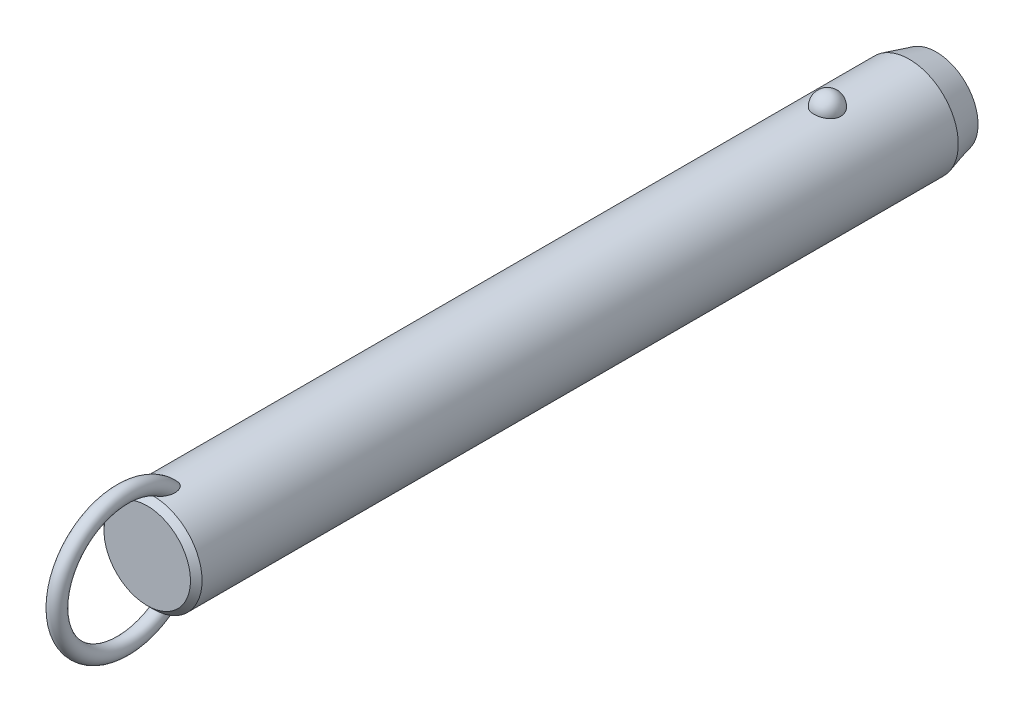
ISO-10303-21;
HEADER;
FILE_DESCRIPTION(('STEP AP214'),'2;1');
FILE_NAME('part.step','',(''),(''),'','','');
FILE_SCHEMA(('AUTOMOTIVE_DESIGN { 1 0 10303 214 1 1 1 1 }'));
ENDSEC;
DATA;
#1=APPLICATION_CONTEXT('core data for automotive mechanical design processes');
#2=APPLICATION_PROTOCOL_DEFINITION('international standard','automotive_design',2000,#1);
#3=PRODUCT_CONTEXT('',#1,'mechanical');
#4=PRODUCT('Part','Part','',(#3));
#5=PRODUCT_RELATED_PRODUCT_CATEGORY('part','',(#4));
#6=PRODUCT_DEFINITION_FORMATION('','',#4);
#7=PRODUCT_DEFINITION_CONTEXT('part definition',#1,'design');
#8=PRODUCT_DEFINITION('design','',#6,#7);
#9=PRODUCT_DEFINITION_SHAPE('','',#8);
#10=(LENGTH_UNIT() NAMED_UNIT(*) SI_UNIT(.MILLI.,.METRE.));
#11=(NAMED_UNIT(*) PLANE_ANGLE_UNIT() SI_UNIT($,.RADIAN.));
#12=(NAMED_UNIT(*) SI_UNIT($,.STERADIAN.) SOLID_ANGLE_UNIT());
#13=UNCERTAINTY_MEASURE_WITH_UNIT(LENGTH_MEASURE(1.E-05),#10,'distance_accuracy_value','');
#14=(GEOMETRIC_REPRESENTATION_CONTEXT(3) GLOBAL_UNCERTAINTY_ASSIGNED_CONTEXT((#13)) GLOBAL_UNIT_ASSIGNED_CONTEXT((#10,
#11,#12)) REPRESENTATION_CONTEXT('',''));
#15=CARTESIAN_POINT('',(0.,0.,0.));
#16=DIRECTION('',(0.,0.,1.));
#17=DIRECTION('',(1.,0.,0.));
#18=AXIS2_PLACEMENT_3D('',#15,#16,#17);
#19=CARTESIAN_POINT('',(0.,0.,160.));
#20=DIRECTION('',(0.,0.,-1.));
#21=DIRECTION('',(-1.,0.,0.));
#22=AXIS2_PLACEMENT_3D('',#19,#20,#21);
#23=CYLINDRICAL_SURFACE('',#22,12.7);
#24=CARTESIAN_POINT('',(3.46661256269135,12.2177165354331,-3.50000000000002));
#25=CARTESIAN_POINT('',(3.4666090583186,12.2177194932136,-3.30432790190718));
#26=CARTESIAN_POINT('',(3.45063567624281,12.2222841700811,-3.10861112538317));
#27=CARTESIAN_POINT('',(3.38712451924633,12.2400345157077,-2.72271899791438));
#28=CARTESIAN_POINT('',(3.33957415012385,12.2532236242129,-2.53254588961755));
#29=CARTESIAN_POINT('',(3.2141234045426,12.286724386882,-2.16324948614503));
#30=CARTESIAN_POINT('',(3.13623639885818,12.3070329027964,-1.98412136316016));
#31=CARTESIAN_POINT('',(2.95205930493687,12.3525018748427,-1.6418059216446));
#32=CARTESIAN_POINT('',(2.84577003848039,12.3776621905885,-1.47861814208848));
#33=CARTESIAN_POINT('',(2.60688050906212,12.4301712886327,-1.17190583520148));
#34=CARTESIAN_POINT('',(2.47415697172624,12.4575299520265,-1.0284789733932));
#35=CARTESIAN_POINT('',(2.18615174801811,12.5112810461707,-0.766177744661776));
#36=CARTESIAN_POINT('',(2.03087002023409,12.5376734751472,-0.647303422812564));
#37=CARTESIAN_POINT('',(1.70237334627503,12.5864761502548,-0.437732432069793));
#38=CARTESIAN_POINT('',(1.52920948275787,12.6088972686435,-0.346958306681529));
#39=CARTESIAN_POINT('',(1.16944170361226,12.6473352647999,-0.195750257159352));
#40=CARTESIAN_POINT('',(0.982839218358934,12.663352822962,-0.135313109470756));
#41=CARTESIAN_POINT('',(0.604961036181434,12.6869706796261,-0.0473241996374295));
#42=CARTESIAN_POINT('',(0.41382314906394,12.6947125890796,-0.0192185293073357));
#43=CARTESIAN_POINT('',(0.0293827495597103,12.7014203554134,0.00517254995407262));
#44=CARTESIAN_POINT('',(-0.163919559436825,12.7003870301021,0.00146092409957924));
#45=CARTESIAN_POINT('',(-0.544374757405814,12.689735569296,-0.0373939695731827));
#46=CARTESIAN_POINT('',(-0.731575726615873,12.6802364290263,-0.0721015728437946));
#47=CARTESIAN_POINT('',(-1.09733277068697,12.6538333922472,-0.171364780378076));
#48=CARTESIAN_POINT('',(-1.27588869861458,12.6369293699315,-0.235920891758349));
#49=CARTESIAN_POINT('',(-1.6204698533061,12.5973946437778,-0.393548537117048));
#50=CARTESIAN_POINT('',(-1.78641865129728,12.5747321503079,-0.486778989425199));
#51=CARTESIAN_POINT('',(-2.10030671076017,12.5261316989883,-0.699110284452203));
#52=CARTESIAN_POINT('',(-2.24824419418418,12.5001934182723,-0.818213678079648));
#53=CARTESIAN_POINT('',(-2.52491489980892,12.4472906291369,-1.0815712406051));
#54=CARTESIAN_POINT('',(-2.65324222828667,12.4203160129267,-1.22624992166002));
#55=CARTESIAN_POINT('',(-2.88410007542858,12.3687509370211,-1.53528325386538));
#56=CARTESIAN_POINT('',(-2.98662883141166,12.3441606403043,-1.69963924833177));
#57=CARTESIAN_POINT('',(-3.16432417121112,12.2998199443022,-2.04548497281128));
#58=CARTESIAN_POINT('',(-3.23917525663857,12.2801261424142,-2.22714424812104));
#59=CARTESIAN_POINT('',(-3.35800573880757,12.248167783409,-2.60091389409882));
#60=CARTESIAN_POINT('',(-3.4019860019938,12.2359030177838,-2.79302397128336));
#61=CARTESIAN_POINT('',(-3.45784812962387,12.2202347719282,-3.18140279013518));
#62=CARTESIAN_POINT('',(-3.46986123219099,12.2167950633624,-3.37765118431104));
#63=CARTESIAN_POINT('',(-3.46186273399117,12.2190638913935,-3.76943689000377));
#64=CARTESIAN_POINT('',(-3.44185196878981,12.2247721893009,-3.96497421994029));
#65=CARTESIAN_POINT('',(-3.37048652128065,12.2446381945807,-4.34881728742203));
#66=CARTESIAN_POINT('',(-3.31928253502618,12.2587552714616,-4.53715319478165));
#67=CARTESIAN_POINT('',(-3.18693461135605,12.2938237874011,-4.9023172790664));
#68=CARTESIAN_POINT('',(-3.1057895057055,12.3147754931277,-5.07914500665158));
#69=CARTESIAN_POINT('',(-2.91506431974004,12.3613125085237,-5.41732059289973));
#70=CARTESIAN_POINT('',(-2.80533587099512,12.3869217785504,-5.57858147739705));
#71=CARTESIAN_POINT('',(-2.560414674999,12.4398525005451,-5.88013283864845));
#72=CARTESIAN_POINT('',(-2.42522099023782,12.4671740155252,-6.02042254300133));
#73=CARTESIAN_POINT('',(-2.1323357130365,12.5205965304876,-6.27662798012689));
#74=CARTESIAN_POINT('',(-1.97456596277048,12.5466928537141,-6.39245542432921));
#75=CARTESIAN_POINT('',(-1.64115839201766,12.5946384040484,-6.59583547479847));
#76=CARTESIAN_POINT('',(-1.46552179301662,12.6164879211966,-6.68339001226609));
#77=CARTESIAN_POINT('',(-1.10356050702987,12.6532533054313,-6.82682153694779));
#78=CARTESIAN_POINT('',(-0.9173913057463,12.6682500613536,-6.88306988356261));
#79=CARTESIAN_POINT('',(-0.537836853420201,12.6900288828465,-6.96386887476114));
#80=CARTESIAN_POINT('',(-0.344452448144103,12.6968119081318,-6.98842322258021));
#81=CARTESIAN_POINT('',(0.0402577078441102,12.7013667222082,-7.00496469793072));
#82=CARTESIAN_POINT('',(0.231556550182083,12.6993008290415,-6.99753844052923));
#83=CARTESIAN_POINT('',(0.610105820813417,12.6867505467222,-6.95166366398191));
#84=CARTESIAN_POINT('',(0.797356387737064,12.6762664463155,-6.91321620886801));
#85=CARTESIAN_POINT('',(1.16186657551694,12.6480587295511,-6.80658431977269));
#86=CARTESIAN_POINT('',(1.33915951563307,12.6303611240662,-6.73850666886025));
#87=CARTESIAN_POINT('',(1.67968518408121,12.5896027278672,-6.57450875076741));
#88=CARTESIAN_POINT('',(1.84291705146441,12.5665416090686,-6.47858678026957));
#89=CARTESIAN_POINT('',(2.15340192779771,12.5171072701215,-6.25982455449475));
#90=CARTESIAN_POINT('',(2.30037831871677,12.4906895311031,-6.13660186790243));
#91=CARTESIAN_POINT('',(2.5717412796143,12.4376567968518,-5.86739587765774));
#92=CARTESIAN_POINT('',(2.69612388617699,12.4110417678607,-5.72140858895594));
#93=CARTESIAN_POINT('',(2.92107785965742,12.360051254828,-5.40794137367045));
#94=CARTESIAN_POINT('',(3.02121329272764,12.3357209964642,-5.24014110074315));
#95=CARTESIAN_POINT('',(3.19236291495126,12.2925446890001,-4.88969865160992));
#96=CARTESIAN_POINT('',(3.26338839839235,12.2736965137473,-4.70706226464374));
#97=CARTESIAN_POINT('',(3.36788038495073,12.245404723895,-4.35469510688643));
#98=CARTESIAN_POINT('',(3.40484026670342,12.2351018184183,-4.18605935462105));
#99=CARTESIAN_POINT('',(3.45420764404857,12.2212564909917,-3.84496058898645));
#100=CARTESIAN_POINT('',(3.46661565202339,12.2177139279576,-3.67249765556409));
#101=CARTESIAN_POINT('',(3.46661256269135,12.2177165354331,-3.50000000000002));
#102=B_SPLINE_CURVE_WITH_KNOTS('',3,(#24,#25,#26,#27,#28,#29,#30,#31,#32,#33,#34,#35,#36,#37,
#38,#39,#40,#41,#42,#43,#44,#45,#46,#47,#48,#49,#50,#51,#52,#53,#54,#55,#56,#57,#58,#59,#60,#61,
#62,#63,#64,#65,#66,#67,#68,#69,#70,#71,#72,#73,#74,#75,#76,#77,#78,#79,#80,#81,#82,#83,#84,#85,
#86,#87,#88,#89,#90,#91,#92,#93,#94,#95,#96,#97,#98,#99,#100,#101),.UNSPECIFIED.,.T.,.F.,(4,2,2,
2,2,2,2,2,2,2,2,2,2,2,2,2,2,2,2,2,2,2,2,2,2,2,2,2,2,2,2,2,2,2,2,2,2,2,4),(0.,0.586396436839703,
1.17302689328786,1.7593990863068,2.34575431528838,2.93491084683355,3.52406845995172,
4.11158733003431,4.69904375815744,5.2762784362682,5.85345931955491,6.42265312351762,
6.99185659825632,7.56427334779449,8.136746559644,8.71981013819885,9.3029135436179,
9.89247258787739,10.4820150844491,11.0691335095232,11.6562366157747,12.2405256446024,
12.8248374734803,13.412244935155,13.9996740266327,14.5891883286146,15.1786623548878,
15.7609861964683,16.3432419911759,16.9148635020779,17.4864654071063,18.0560241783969,
18.6256177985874,19.2037609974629,19.7820055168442,20.3699810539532,20.957728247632,
21.4746855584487,21.9916320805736),.UNSPECIFIED.);
#103=CARTESIAN_POINT('',(3.46661256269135,12.2177165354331,-3.50000000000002));
#104=VERTEX_POINT('',#103);
#105=EDGE_CURVE('E41',#104,#104,#102,.T.);
#106=ORIENTED_EDGE('',*,*,#105,.T.);
#107=EDGE_LOOP('',(#106));
#108=FACE_BOUND('',#107,.T.);
#109=CARTESIAN_POINT('',(0.,0.,171.2));
#110=DIRECTION('',(0.,0.,1.));
#111=DIRECTION('',(1.,0.,0.));
#112=AXIS2_PLACEMENT_3D('',#109,#110,#111);
#113=CIRCLE('',#112,12.7);
#114=CARTESIAN_POINT('',(12.7,0.,171.2));
#115=VERTEX_POINT('',#114);
#116=EDGE_CURVE('E10',#115,#115,#113,.F.);
#117=ORIENTED_EDGE('',*,*,#116,.T.);
#118=EDGE_LOOP('',(#117));
#119=FACE_BOUND('',#118,.T.);
#120=CARTESIAN_POINT('',(-0.548122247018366,-12.6881662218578,164.943218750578));
#121=CARTESIAN_POINT('',(-0.648865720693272,-12.6838128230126,164.977926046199));
#122=CARTESIAN_POINT('',(-0.746398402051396,-12.6783867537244,165.022042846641));
#123=CARTESIAN_POINT('',(-0.932125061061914,-12.666091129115,165.126764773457));
#124=CARTESIAN_POINT('',(-1.02030388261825,-12.6592192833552,165.187396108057));
#125=CARTESIAN_POINT('',(-1.18487740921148,-12.6448747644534,165.321847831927));
#126=CARTESIAN_POINT('',(-1.26134296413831,-12.637406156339,165.395582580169));
#127=CARTESIAN_POINT('',(-1.4023120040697,-12.6225412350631,165.553604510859));
#128=CARTESIAN_POINT('',(-1.466814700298,-12.6151449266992,165.63789238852));
#129=CARTESIAN_POINT('',(-1.60714786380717,-12.5981718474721,165.849657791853));
#130=CARTESIAN_POINT('',(-1.67725126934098,-12.588900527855,165.980962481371));
#131=CARTESIAN_POINT('',(-1.79536591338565,-12.5725964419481,166.253247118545));
#132=CARTESIAN_POINT('',(-1.84333535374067,-12.5655679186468,166.394244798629));
#133=CARTESIAN_POINT('',(-1.93422576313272,-12.5519624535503,166.737645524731));
#134=CARTESIAN_POINT('',(-1.96788773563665,-12.5466298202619,166.942557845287));
#135=CARTESIAN_POINT('',(-1.9941399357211,-12.542463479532,167.251760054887));
#136=CARTESIAN_POINT('',(-1.99883864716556,-12.5417153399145,167.355298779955));
#137=CARTESIAN_POINT('',(-2.00078003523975,-12.5414074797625,167.56245124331));
#138=CARTESIAN_POINT('',(-1.99802449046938,-12.5418474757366,167.666064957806));
#139=CARTESIAN_POINT('',(-1.98336733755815,-12.5441750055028,167.91032076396));
#140=CARTESIAN_POINT('',(-1.96851430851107,-12.5465291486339,168.050780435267));
#141=CARTESIAN_POINT('',(-1.92707089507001,-12.5529612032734,168.329960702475));
#142=CARTESIAN_POINT('',(-1.90047458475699,-12.5570399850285,168.468680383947));
#143=CARTESIAN_POINT('',(-1.83619120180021,-12.5666008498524,168.74341135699));
#144=CARTESIAN_POINT('',(-1.79850828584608,-12.57208240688,168.879423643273));
#145=CARTESIAN_POINT('',(-1.71223796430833,-12.5841228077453,169.147842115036));
#146=CARTESIAN_POINT('',(-1.66365679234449,-12.5906810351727,169.280250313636));
#147=CARTESIAN_POINT('',(-1.57804503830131,-12.6016176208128,169.48548877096));
#148=CARTESIAN_POINT('',(-1.54477252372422,-12.6057501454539,169.559914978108));
#149=CARTESIAN_POINT('',(-1.47424480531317,-12.6141930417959,169.706839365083));
#150=CARTESIAN_POINT('',(-1.43699041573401,-12.6185033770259,169.779337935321));
#151=CARTESIAN_POINT('',(-1.35825795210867,-12.6272207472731,169.921892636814));
#152=CARTESIAN_POINT('',(-1.31678520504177,-12.6316276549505,169.991951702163));
#153=CARTESIAN_POINT('',(-1.22917793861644,-12.6404532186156,170.129070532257));
#154=CARTESIAN_POINT('',(-1.18304514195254,-12.6448718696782,170.196131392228));
#155=CARTESIAN_POINT('',(-1.07246411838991,-12.6547893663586,170.343874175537));
#156=CARTESIAN_POINT('',(-1.0064223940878,-12.6602600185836,170.423384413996));
#157=CARTESIAN_POINT('',(-0.864441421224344,-12.6707460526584,170.573169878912));
#158=CARTESIAN_POINT('',(-0.788516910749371,-12.6757620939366,170.643458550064));
#159=CARTESIAN_POINT('',(-0.652215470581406,-12.6833591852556,170.748680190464));
#160=CARTESIAN_POINT('',(-0.594982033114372,-12.6861973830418,170.787624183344));
#161=CARTESIAN_POINT('',(-0.475269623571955,-12.6912445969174,170.856489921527));
#162=CARTESIAN_POINT('',(-0.412800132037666,-12.6934547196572,170.886427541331));
#163=CARTESIAN_POINT('',(-0.295749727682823,-12.6966636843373,170.92975652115));
#164=CARTESIAN_POINT('',(-0.2419499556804,-12.6978134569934,170.945218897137));
#165=CARTESIAN_POINT('',(-0.13250810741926,-12.6994261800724,170.966884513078));
#166=CARTESIAN_POINT('',(-0.0768679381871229,-12.6998898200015,170.973097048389));
#167=CARTESIAN_POINT('',(0.0347696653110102,-12.7000752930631,170.975583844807));
#168=CARTESIAN_POINT('',(0.0907676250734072,-12.6997954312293,170.971835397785));
#169=CARTESIAN_POINT('',(0.20128301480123,-12.6985255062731,170.954788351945));
#170=CARTESIAN_POINT('',(0.255799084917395,-12.6975348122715,170.941481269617));
#171=CARTESIAN_POINT('',(0.376042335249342,-12.6946091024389,170.90203792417));
#172=CARTESIAN_POINT('',(0.440950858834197,-12.6924943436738,170.873449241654));
#173=CARTESIAN_POINT('',(0.56535027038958,-12.6875639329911,170.806323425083));
#174=CARTESIAN_POINT('',(0.624828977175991,-12.6847467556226,170.767764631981));
#175=CARTESIAN_POINT('',(0.774116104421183,-12.6767252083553,170.656949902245));
#176=CARTESIAN_POINT('',(0.859449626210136,-12.6711344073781,170.578760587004));
#177=CARTESIAN_POINT('',(1.01789440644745,-12.6593922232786,170.410943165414));
#178=CARTESIAN_POINT('',(1.09096902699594,-12.653239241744,170.321282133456));
#179=CARTESIAN_POINT('',(1.22268793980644,-12.6411674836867,170.140265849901));
#180=CARTESIAN_POINT('',(1.28193986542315,-12.6352572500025,170.049345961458));
#181=CARTESIAN_POINT('',(1.39259777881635,-12.6235401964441,169.862792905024));
#182=CARTESIAN_POINT('',(1.44399707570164,-12.6177334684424,169.767155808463));
#183=CARTESIAN_POINT('',(1.53972870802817,-12.6064093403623,169.572273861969));
#184=CARTESIAN_POINT('',(1.58405262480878,-12.6008922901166,169.473024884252));
#185=CARTESIAN_POINT('',(1.66600705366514,-12.5903187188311,169.271772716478));
#186=CARTESIAN_POINT('',(1.70363651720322,-12.5852622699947,169.169769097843));
#187=CARTESIAN_POINT('',(1.77545379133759,-12.5753406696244,168.954358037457));
#188=CARTESIAN_POINT('',(1.80903453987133,-12.5705328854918,168.840745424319));
#189=CARTESIAN_POINT('',(1.86844163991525,-12.5618400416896,168.611457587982));
#190=CARTESIAN_POINT('',(1.89426665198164,-12.5579551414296,168.495782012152));
#191=CARTESIAN_POINT('',(1.93785464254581,-12.5513030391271,168.263007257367));
#192=CARTESIAN_POINT('',(1.95562640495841,-12.5485346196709,168.145909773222));
#193=CARTESIAN_POINT('',(1.98264463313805,-12.5442934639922,167.910747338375));
#194=CARTESIAN_POINT('',(1.99189298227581,-12.5428204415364,167.79268260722));
#195=CARTESIAN_POINT('',(2.00416068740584,-12.540871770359,167.480622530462));
#196=CARTESIAN_POINT('',(1.99944433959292,-12.541631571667,167.286229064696));
#197=CARTESIAN_POINT('',(1.96113755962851,-12.5476846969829,166.900309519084));
#198=CARTESIAN_POINT('',(1.92758341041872,-12.5529723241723,166.708780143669));
#199=CARTESIAN_POINT('',(1.83934342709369,-12.5661532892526,166.382272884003));
#200=CARTESIAN_POINT('',(1.79215440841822,-12.5730485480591,166.24524997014));
#201=CARTESIAN_POINT('',(1.67676242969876,-12.588958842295,165.980445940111));
#202=CARTESIAN_POINT('',(1.60859050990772,-12.597970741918,165.852651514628));
#203=CARTESIAN_POINT('',(1.46583832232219,-12.6152829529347,165.635800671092));
#204=CARTESIAN_POINT('',(1.39525727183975,-12.6233659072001,165.54410500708));
#205=CARTESIAN_POINT('',(1.2399259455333,-12.6395676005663,165.373485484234));
#206=CARTESIAN_POINT('',(1.15517932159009,-12.6476863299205,165.294558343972));
#207=CARTESIAN_POINT('',(0.971995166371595,-12.6630846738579,165.152643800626));
#208=CARTESIAN_POINT('',(0.873456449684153,-12.6703572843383,165.089784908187));
#209=CARTESIAN_POINT('',(0.665847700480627,-12.6829569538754,164.984487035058));
#210=CARTESIAN_POINT('',(0.556784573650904,-12.688285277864,164.942034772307));
#211=CARTESIAN_POINT('',(0.347338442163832,-12.6956226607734,164.884443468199));
#212=CARTESIAN_POINT('',(0.24775974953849,-12.6979816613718,164.866399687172));
#213=CARTESIAN_POINT('',(0.0470218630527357,-12.7003077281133,164.848600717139));
#214=CARTESIAN_POINT('',(-0.0541350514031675,-12.7002779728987,164.848821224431));
#215=CARTESIAN_POINT('',(-0.22141402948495,-12.6982482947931,164.864363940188));
#216=CARTESIAN_POINT('',(-0.288055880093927,-12.6969033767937,164.874666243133));
#217=CARTESIAN_POINT('',(-0.419599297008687,-12.6932369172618,164.90313489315));
#218=CARTESIAN_POINT('',(-0.484501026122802,-12.6909154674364,164.921300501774));
#219=CARTESIAN_POINT('',(-0.548122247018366,-12.6881662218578,164.943218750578));
#220=B_SPLINE_CURVE_WITH_KNOTS('',3,(#120,#121,#122,#123,#124,#125,#126,#127,#128,#129,#130,
#131,#132,#133,#134,#135,#136,#137,#138,#139,#140,#141,#142,#143,#144,#145,#146,#147,#148,#149,
#150,#151,#152,#153,#154,#155,#156,#157,#158,#159,#160,#161,#162,#163,#164,#165,#166,#167,#168,
#169,#170,#171,#172,#173,#174,#175,#176,#177,#178,#179,#180,#181,#182,#183,#184,#185,#186,#187,
#188,#189,#190,#191,#192,#193,#194,#195,#196,#197,#198,#199,#200,#201,#202,#203,#204,#205,#206,
#207,#208,#209,#210,#211,#212,#213,#214,#215,#216,#217,#218,#219),.UNSPECIFIED.,.T.,.F.,(4,2,2,
2,2,2,2,2,2,2,2,2,2,2,2,2,2,2,2,2,2,2,2,2,2,2,2,2,2,2,2,2,2,2,2,2,2,2,2,2,2,2,2,2,2,2,2,2,2,4),
(0.,0.31964225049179,0.639794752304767,0.957927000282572,1.27608021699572,1.72100165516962,
2.16675988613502,2.78630021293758,3.09705782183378,3.40774128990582,3.83096358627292,
4.25439969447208,4.67767724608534,5.1007133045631,5.34550297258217,5.59024267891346,
5.83467707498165,6.07902143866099,6.38891080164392,6.69834321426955,6.90560910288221,
7.11250749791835,7.27977315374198,7.44687060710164,7.61434932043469,7.78197685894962,
7.99365544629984,8.20579780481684,8.55147335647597,8.89816429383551,9.22375138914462,
9.54961437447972,9.87586224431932,10.202161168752,10.557587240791,10.9130746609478,
11.2681734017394,11.6231936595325,12.2046601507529,12.7853961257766,13.219164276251,
13.6522938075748,13.9989174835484,14.3454519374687,14.6946768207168,15.0436740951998,
15.3457513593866,15.6474266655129,15.8493051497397,16.0511646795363),.UNSPECIFIED.);
#221=CARTESIAN_POINT('',(-0.548122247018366,-12.6881662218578,164.943218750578));
#222=VERTEX_POINT('',#221);
#223=EDGE_CURVE('E60',#222,#222,#220,.T.);
#224=ORIENTED_EDGE('',*,*,#223,.T.);
#225=EDGE_LOOP('',(#224));
#226=FACE_BOUND('',#225,.T.);
#227=CARTESIAN_POINT('',(-0.548122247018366,12.6881662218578,164.943218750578));
#228=CARTESIAN_POINT('',(-0.459436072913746,12.6919968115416,164.912673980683));
#229=CARTESIAN_POINT('',(-0.368189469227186,12.6949996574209,164.889391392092));
#230=CARTESIAN_POINT('',(-0.183024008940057,12.6990186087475,164.858406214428));
#231=CARTESIAN_POINT('',(-0.0891049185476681,12.7000345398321,164.850704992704));
#232=CARTESIAN_POINT('',(0.0987147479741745,12.6999636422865,164.851245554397));
#233=CARTESIAN_POINT('',(0.192615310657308,12.6988761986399,164.859492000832));
#234=CARTESIAN_POINT('',(0.377658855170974,12.6947211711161,164.891551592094));
#235=CARTESIAN_POINT('',(0.468801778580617,12.6916535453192,164.915365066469));
#236=CARTESIAN_POINT('',(0.645809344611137,12.6838788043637,164.97745651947));
#237=CARTESIAN_POINT('',(0.731679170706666,12.6791733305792,165.015720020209));
#238=CARTESIAN_POINT('',(0.896315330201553,12.6686004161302,165.105120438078));
#239=CARTESIAN_POINT('',(0.97508059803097,12.6627328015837,165.156259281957));
#240=CARTESIAN_POINT('',(1.12963655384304,12.6499161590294,165.27367820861));
#241=CARTESIAN_POINT('',(1.20478673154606,12.6429194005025,165.340792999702));
#242=CARTESIAN_POINT('',(1.34448241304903,12.6288282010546,165.48522507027));
#243=CARTESIAN_POINT('',(1.40902173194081,12.621733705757,165.562548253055));
#244=CARTESIAN_POINT('',(1.55208211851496,12.6050877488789,165.759247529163));
#245=CARTESIAN_POINT('',(1.62510490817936,12.5957546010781,165.882654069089));
#246=CARTESIAN_POINT('',(1.75019044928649,12.5789823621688,166.139769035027));
#247=CARTESIAN_POINT('',(1.8022137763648,12.5715468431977,166.273496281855));
#248=CARTESIAN_POINT('',(1.90309965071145,12.5567434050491,166.598351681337));
#249=CARTESIAN_POINT('',(1.94342317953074,12.5504515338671,166.792161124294));
#250=CARTESIAN_POINT('',(1.99332997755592,12.5426147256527,167.18378810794));
#251=CARTESIAN_POINT('',(2.00285305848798,12.5410790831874,167.381612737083));
#252=CARTESIAN_POINT('',(1.99678999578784,12.5420407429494,167.716642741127));
#253=CARTESIAN_POINT('',(1.98794117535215,12.5434564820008,167.854042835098));
#254=CARTESIAN_POINT('',(1.95865119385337,12.5480641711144,168.127639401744));
#255=CARTESIAN_POINT('',(1.93820436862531,12.5512569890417,168.263835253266));
#256=CARTESIAN_POINT('',(1.88647896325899,12.5591352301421,168.534249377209));
#257=CARTESIAN_POINT('',(1.85518800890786,12.5638223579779,168.668465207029));
#258=CARTESIAN_POINT('',(1.78217886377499,12.5743868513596,168.933936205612));
#259=CARTESIAN_POINT('',(1.74046509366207,12.5802637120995,169.065192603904));
#260=CARTESIAN_POINT('',(1.66024095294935,12.5910571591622,169.286085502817));
#261=CARTESIAN_POINT('',(1.62434772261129,12.5957535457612,169.376690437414));
#262=CARTESIAN_POINT('',(1.54709009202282,12.6054762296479,169.555512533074));
#263=CARTESIAN_POINT('',(1.50572681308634,12.6105024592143,169.643730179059));
#264=CARTESIAN_POINT('',(1.41728020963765,12.620748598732,169.816932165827));
#265=CARTESIAN_POINT('',(1.37021377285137,12.625967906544,169.901925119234));
#266=CARTESIAN_POINT('',(1.26969620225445,12.6364721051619,170.068007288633));
#267=CARTESIAN_POINT('',(1.21624929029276,12.6417569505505,170.149099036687));
#268=CARTESIAN_POINT('',(1.1030441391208,12.6521331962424,170.304702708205));
#269=CARTESIAN_POINT('',(1.04340936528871,12.657226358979,170.379303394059));
#270=CARTESIAN_POINT('',(0.915919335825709,12.667090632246,170.521324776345));
#271=CARTESIAN_POINT('',(0.848064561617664,12.6718617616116,170.58874589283));
#272=CARTESIAN_POINT('',(0.717035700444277,12.67987711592,170.700624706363));
#273=CARTESIAN_POINT('',(0.655526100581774,12.6832377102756,170.746997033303));
#274=CARTESIAN_POINT('',(0.525985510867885,12.6892676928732,170.829619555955));
#275=CARTESIAN_POINT('',(0.457969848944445,12.6919386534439,170.865892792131));
#276=CARTESIAN_POINT('',(0.334859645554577,12.695691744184,170.916657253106));
#277=CARTESIAN_POINT('',(0.281116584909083,12.6970073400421,170.934373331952));
#278=CARTESIAN_POINT('',(0.171425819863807,12.6989609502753,170.960642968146));
#279=CARTESIAN_POINT('',(0.115480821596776,12.699599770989,170.969207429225));
#280=CARTESIAN_POINT('',(0.00272618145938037,12.7001251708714,170.976253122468));
#281=CARTESIAN_POINT('',(-0.0540859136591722,12.7000089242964,170.974696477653));
#282=CARTESIAN_POINT('',(-0.16654462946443,12.6990328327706,170.961600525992));
#283=CARTESIAN_POINT('',(-0.222190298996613,12.6981724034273,170.950053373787));
#284=CARTESIAN_POINT('',(-0.342018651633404,12.695562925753,170.914912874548));
#285=CARTESIAN_POINT('',(-0.405606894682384,12.6936676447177,170.88933225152));
#286=CARTESIAN_POINT('',(-0.527815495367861,12.6891754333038,170.828311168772));
#287=CARTESIAN_POINT('',(-0.586425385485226,12.6865770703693,170.792850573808));
#288=CARTESIAN_POINT('',(-0.731842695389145,12.6792129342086,170.691496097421));
#289=CARTESIAN_POINT('',(-0.81470941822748,12.6740767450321,170.6200395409));
#290=CARTESIAN_POINT('',(-0.969101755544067,12.6632083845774,170.46589007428));
#291=CARTESIAN_POINT('',(-1.04059564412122,12.6574746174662,170.383166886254));
#292=CARTESIAN_POINT('',(-1.16981116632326,12.6461638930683,170.215809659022));
#293=CARTESIAN_POINT('',(-1.22811369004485,12.6405994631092,170.131616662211));
#294=CARTESIAN_POINT('',(-1.33743405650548,12.6295007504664,169.958579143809));
#295=CARTESIAN_POINT('',(-1.38844577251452,12.6239664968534,169.869730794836));
#296=CARTESIAN_POINT('',(-1.48400702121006,12.6130898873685,169.688389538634));
#297=CARTESIAN_POINT('',(-1.52854232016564,12.6077479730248,169.595889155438));
#298=CARTESIAN_POINT('',(-1.61150113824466,12.5974127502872,169.408160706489));
#299=CARTESIAN_POINT('',(-1.64992317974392,12.5924195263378,169.312931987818));
#300=CARTESIAN_POINT('',(-1.73468589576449,12.581070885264,169.08289362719));
#301=CARTESIAN_POINT('',(-1.77831261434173,12.5749388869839,168.947066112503));
#302=CARTESIAN_POINT('',(-1.85439734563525,12.5639437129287,168.672212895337));
#303=CARTESIAN_POINT('',(-1.88684994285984,12.5590811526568,168.533185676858));
#304=CARTESIAN_POINT('',(-1.94008483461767,12.550968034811,168.25309235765));
#305=CARTESIAN_POINT('',(-1.96088706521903,12.5477147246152,168.112030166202));
#306=CARTESIAN_POINT('',(-1.99000539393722,12.5431291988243,167.828668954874));
#307=CARTESIAN_POINT('',(-1.99832911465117,12.5417958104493,167.686370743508));
#308=CARTESIAN_POINT('',(-2.00166624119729,12.5412674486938,167.357627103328));
#309=CARTESIAN_POINT('',(-1.99178843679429,12.5428579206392,167.171088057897));
#310=CARTESIAN_POINT('',(-1.94455183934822,12.5502731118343,166.80162404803));
#311=CARTESIAN_POINT('',(-1.90724032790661,12.5560905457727,166.618693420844));
#312=CARTESIAN_POINT('',(-1.81330718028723,12.5699462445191,166.304848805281));
#313=CARTESIAN_POINT('',(-1.76338820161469,12.5771273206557,166.171910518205));
#314=CARTESIAN_POINT('',(-1.64305018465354,12.593414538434,165.915681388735));
#315=CARTESIAN_POINT('',(-1.57265346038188,12.6025185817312,165.792380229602));
#316=CARTESIAN_POINT('',(-1.42634956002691,12.6198178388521,165.583564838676));
#317=CARTESIAN_POINT('',(-1.35423772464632,12.6278405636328,165.495384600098));
#318=CARTESIAN_POINT('',(-1.19645664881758,12.6437632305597,165.332107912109));
#319=CARTESIAN_POINT('',(-1.1108053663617,12.6516633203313,165.256994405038));
#320=CARTESIAN_POINT('',(-0.947219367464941,12.6648319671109,165.137811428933));
#321=CARTESIAN_POINT('',(-0.871624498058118,12.670300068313,165.090541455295));
#322=CARTESIAN_POINT('',(-0.714161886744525,12.6801492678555,165.0077413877));
#323=CARTESIAN_POINT('',(-0.632295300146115,12.684530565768,164.97220913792));
#324=CARTESIAN_POINT('',(-0.548122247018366,12.6881662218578,164.943218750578));
#325=B_SPLINE_CURVE_WITH_KNOTS('',3,(#227,#228,#229,#230,#231,#232,#233,#234,#235,#236,#237,
#238,#239,#240,#241,#242,#243,#244,#245,#246,#247,#248,#249,#250,#251,#252,#253,#254,#255,#256,
#257,#258,#259,#260,#261,#262,#263,#264,#265,#266,#267,#268,#269,#270,#271,#272,#273,#274,#275,
#276,#277,#278,#279,#280,#281,#282,#283,#284,#285,#286,#287,#288,#289,#290,#291,#292,#293,#294,
#295,#296,#297,#298,#299,#300,#301,#302,#303,#304,#305,#306,#307,#308,#309,#310,#311,#312,#313,
#314,#315,#316,#317,#318,#319,#320,#321,#322,#323,#324),.UNSPECIFIED.,.T.,.F.,(4,2,2,2,2,2,2,2,
2,2,2,2,2,2,2,2,2,2,2,2,2,2,2,2,2,2,2,2,2,2,2,2,2,2,2,2,2,2,2,2,2,2,2,2,2,2,2,2,4),(0.,
0.281328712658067,0.562682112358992,0.844117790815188,1.12555942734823,1.40671982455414,
1.68792232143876,1.98972294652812,2.29169886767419,2.72039860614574,3.14989948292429,
3.74084916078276,4.33295293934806,4.74554109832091,5.15833092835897,5.57159335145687,
5.98468079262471,6.27722775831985,6.56971484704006,6.86135609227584,7.15280542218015,
7.43927407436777,7.72572595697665,7.95635862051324,8.18646071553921,8.35559393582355,
8.52452541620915,8.69408946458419,8.86378678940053,9.06834348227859,9.27332014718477,
9.60010414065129,9.92778432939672,10.2350252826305,10.5425229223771,10.8506864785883,
11.15892440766,11.5867893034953,12.0148612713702,12.4421984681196,12.8692745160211,
13.4279365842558,13.9856380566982,14.4107062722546,14.835313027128,15.1765567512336,
15.517351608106,15.7844129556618,16.051425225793),.UNSPECIFIED.);
#326=CARTESIAN_POINT('',(-0.548122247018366,12.6881662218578,164.943218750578));
#327=VERTEX_POINT('',#326);
#328=EDGE_CURVE('E68',#327,#327,#325,.T.);
#329=ORIENTED_EDGE('',*,*,#328,.T.);
#330=EDGE_LOOP('',(#329));
#331=FACE_BOUND('',#330,.T.);
#332=CARTESIAN_POINT('',(0.,0.,-24.6999999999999));
#333=DIRECTION('',(0.,0.,-1.));
#334=DIRECTION('',(-1.,0.,0.));
#335=AXIS2_PLACEMENT_3D('',#332,#333,#334);
#336=CIRCLE('',#335,12.7);
#337=CARTESIAN_POINT('',(-12.7,0.,-24.6999999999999));
#338=VERTEX_POINT('',#337);
#339=EDGE_CURVE('E57',#338,#338,#336,.F.);
#340=ORIENTED_EDGE('',*,*,#339,.T.);
#341=EDGE_LOOP('',(#340));
#342=FACE_BOUND('',#341,.T.);
#343=ADVANCED_FACE('F37',(#108,#119,#226,#331,#342),#23,.T.);
#344=CARTESIAN_POINT('',(0.,0.,-31.7));
#345=DIRECTION('',(0.,0.,-1.));
#346=DIRECTION('',(-1.,0.,0.));
#347=AXIS2_PLACEMENT_3D('',#344,#345,#346);
#348=PLANE('',#347);
#349=CARTESIAN_POINT('',(0.,0.,-31.7));
#350=DIRECTION('',(0.,0.,-1.));
#351=DIRECTION('',(-1.,0.,0.));
#352=AXIS2_PLACEMENT_3D('',#349,#350,#351);
#353=CIRCLE('',#352,10.8243556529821);
#354=CARTESIAN_POINT('',(-10.8243556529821,0.,-31.7));
#355=VERTEX_POINT('',#354);
#356=EDGE_CURVE('E67',#355,#355,#353,.T.);
#357=ORIENTED_EDGE('',*,*,#356,.T.);
#358=EDGE_LOOP('',(#357));
#359=FACE_BOUND('',#358,.T.);
#360=ADVANCED_FACE('F86',(#359),#348,.T.);
#361=CARTESIAN_POINT('',(0.,0.,-31.7));
#362=DIRECTION('',(0.,0.,1.));
#363=DIRECTION('',(1.,0.,0.));
#364=AXIS2_PLACEMENT_3D('',#361,#362,#363);
#365=CONICAL_SURFACE('',#364,10.8243556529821,0.261799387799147);
#366=ORIENTED_EDGE('',*,*,#339,.F.);
#367=EDGE_LOOP('',(#366));
#368=FACE_BOUND('',#367,.T.);
#369=ORIENTED_EDGE('',*,*,#356,.F.);
#370=EDGE_LOOP('',(#369));
#371=FACE_BOUND('',#370,.T.);
#372=ADVANCED_FACE('F84',(#368,#371),#365,.T.);
#373=CARTESIAN_POINT('',(0.,0.,172.7));
#374=DIRECTION('',(0.,0.,1.));
#375=DIRECTION('',(1.,0.,0.));
#376=AXIS2_PLACEMENT_3D('',#373,#374,#375);
#377=PLANE('',#376);
#378=CARTESIAN_POINT('',(0.,0.,172.7));
#379=DIRECTION('',(0.,0.,1.));
#380=DIRECTION('',(1.,0.,0.));
#381=AXIS2_PLACEMENT_3D('',#378,#379,#380);
#382=CIRCLE('',#381,11.2);
#383=CARTESIAN_POINT('',(11.2,0.,172.7));
#384=VERTEX_POINT('',#383);
#385=EDGE_CURVE('E50',#384,#384,#382,.T.);
#386=ORIENTED_EDGE('',*,*,#385,.T.);
#387=EDGE_LOOP('',(#386));
#388=FACE_BOUND('',#387,.T.);
#389=ADVANCED_FACE('F78',(#388),#377,.T.);
#390=CARTESIAN_POINT('',(0.,0.,179.05));
#391=DIRECTION('',(1.,0.,0.));
#392=DIRECTION('',(0.,0.,-1.));
#393=AXIS2_PLACEMENT_3D('',#390,#391,#392);
#394=TOROIDAL_SURFACE('',#393,17.05,2.);
#395=ORIENTED_EDGE('',*,*,#328,.F.);
#396=EDGE_LOOP('',(#395));
#397=FACE_BOUND('',#396,.T.);
#398=ORIENTED_EDGE('',*,*,#223,.F.);
#399=EDGE_LOOP('',(#398));
#400=FACE_BOUND('',#399,.T.);
#401=ADVANCED_FACE('F74',(#397,#400),#394,.T.);
#402=CARTESIAN_POINT('',(0.,0.,172.7));
#403=DIRECTION('',(0.,0.,-1.));
#404=DIRECTION('',(-1.,0.,0.));
#405=AXIS2_PLACEMENT_3D('',#402,#403,#404);
#406=CONICAL_SURFACE('',#405,11.2,0.785398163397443);
#407=ORIENTED_EDGE('',*,*,#116,.F.);
#408=EDGE_LOOP('',(#407));
#409=FACE_BOUND('',#408,.T.);
#410=ORIENTED_EDGE('',*,*,#385,.F.);
#411=EDGE_LOOP('',(#410));
#412=FACE_BOUND('',#411,.T.);
#413=ADVANCED_FACE('F39',(#409,#412),#406,.T.);
#414=CARTESIAN_POINT('',(0.,12.7,-3.50000000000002));
#415=DIRECTION('',(0.,1.,0.));
#416=DIRECTION('',(0.,0.,-1.));
#417=AXIS2_PLACEMENT_3D('',#414,#415,#416);
#418=SPHERICAL_SURFACE('',#417,3.5);
#419=ORIENTED_EDGE('',*,*,#105,.F.);
#420=EDGE_LOOP('',(#419));
#421=FACE_BOUND('',#420,.T.);
#422=ADVANCED_FACE('F80',(#421),#418,.T.);
#423=CLOSED_SHELL('',(#343,#360,#372,#389,#401,#413,#422));
#424=MANIFOLD_SOLID_BREP('B2',#423);
#425=ADVANCED_BREP_SHAPE_REPRESENTATION('',(#18,#424),#14);
#426=SHAPE_DEFINITION_REPRESENTATION(#9,#425);
ENDSEC;
END-ISO-10303-21;
